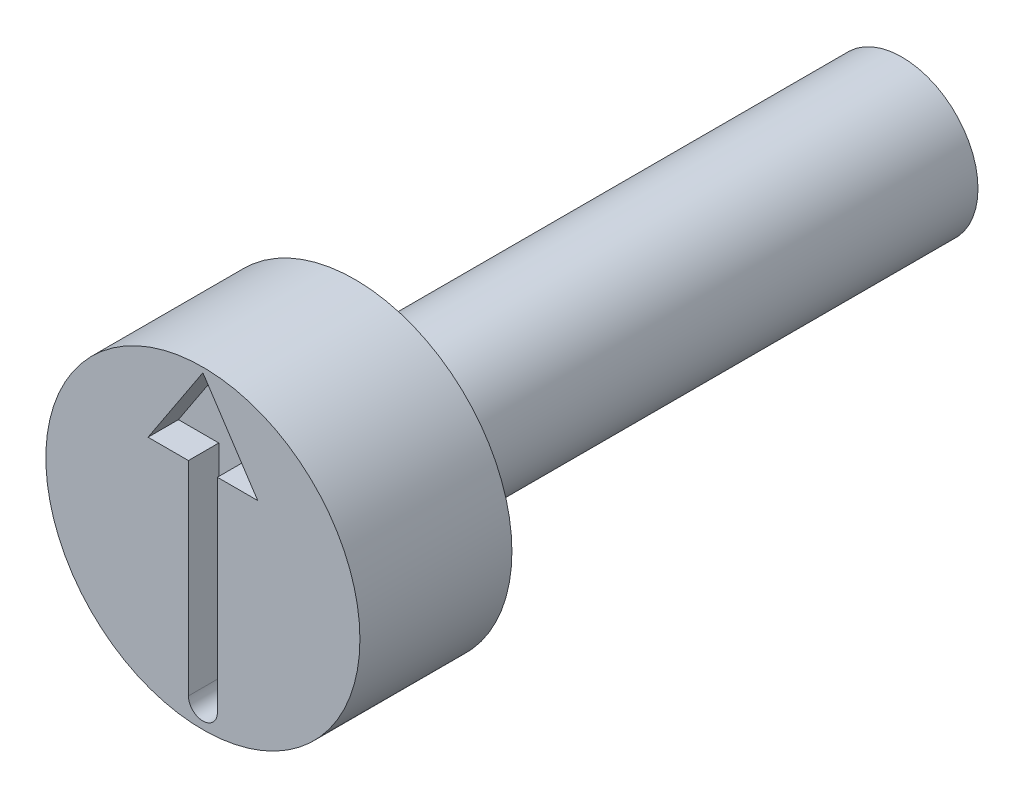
ISO-10303-21;
HEADER;
FILE_DESCRIPTION(('STEP AP214'),'2;1');
FILE_NAME('part.step','',(''),(''),'','','');
FILE_SCHEMA(('AUTOMOTIVE_DESIGN { 1 0 10303 214 1 1 1 1 }'));
ENDSEC;
DATA;
#1=APPLICATION_CONTEXT('core data for automotive mechanical design processes');
#2=APPLICATION_PROTOCOL_DEFINITION('international standard','automotive_design',2000,#1);
#3=PRODUCT_CONTEXT('',#1,'mechanical');
#4=PRODUCT('Part','Part','',(#3));
#5=PRODUCT_RELATED_PRODUCT_CATEGORY('part','',(#4));
#6=PRODUCT_DEFINITION_FORMATION('','',#4);
#7=PRODUCT_DEFINITION_CONTEXT('part definition',#1,'design');
#8=PRODUCT_DEFINITION('design','',#6,#7);
#9=PRODUCT_DEFINITION_SHAPE('','',#8);
#10=(LENGTH_UNIT() NAMED_UNIT(*) SI_UNIT(.MILLI.,.METRE.));
#11=(NAMED_UNIT(*) PLANE_ANGLE_UNIT() SI_UNIT($,.RADIAN.));
#12=(NAMED_UNIT(*) SI_UNIT($,.STERADIAN.) SOLID_ANGLE_UNIT());
#13=UNCERTAINTY_MEASURE_WITH_UNIT(LENGTH_MEASURE(1.E-05),#10,'distance_accuracy_value','');
#14=(GEOMETRIC_REPRESENTATION_CONTEXT(3) GLOBAL_UNCERTAINTY_ASSIGNED_CONTEXT((#13)) GLOBAL_UNIT_ASSIGNED_CONTEXT((#10,
#11,#12)) REPRESENTATION_CONTEXT('',''));
#15=CARTESIAN_POINT('',(0.,0.,0.));
#16=DIRECTION('',(0.,0.,1.));
#17=DIRECTION('',(1.,0.,0.));
#18=AXIS2_PLACEMENT_3D('',#15,#16,#17);
#19=CARTESIAN_POINT('',(0.,1.5,-3.));
#20=DIRECTION('',(0.,0.,1.));
#21=DIRECTION('',(1.,0.,0.));
#22=AXIS2_PLACEMENT_3D('',#19,#20,#21);
#23=PLANE('',#22);
#24=CARTESIAN_POINT('',(0.,0.,-3.));
#25=DIRECTION('',(0.,0.,1.));
#26=DIRECTION('',(1.,0.,0.));
#27=AXIS2_PLACEMENT_3D('',#24,#25,#26);
#28=CIRCLE('',#27,3.1);
#29=CARTESIAN_POINT('',(3.1,0.,-3.));
#30=VERTEX_POINT('',#29);
#31=EDGE_CURVE('E11',#30,#30,#28,.T.);
#32=ORIENTED_EDGE('',*,*,#31,.F.);
#33=EDGE_LOOP('',(#32));
#34=FACE_BOUND('',#33,.T.);
#35=CARTESIAN_POINT('',(0.,0.,-3.));
#36=DIRECTION('',(0.,0.,1.));
#37=DIRECTION('',(1.,0.,0.));
#38=AXIS2_PLACEMENT_3D('',#35,#36,#37);
#39=CIRCLE('',#38,1.5);
#40=CARTESIAN_POINT('',(1.5,0.,-3.));
#41=VERTEX_POINT('',#40);
#42=EDGE_CURVE('E144',#41,#41,#39,.T.);
#43=ORIENTED_EDGE('',*,*,#42,.T.);
#44=EDGE_LOOP('',(#43));
#45=FACE_BOUND('',#44,.T.);
#46=ADVANCED_FACE('F34',(#34,#45),#23,.F.);
#47=CARTESIAN_POINT('',(0.,0.,-0.403888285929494));
#48=DIRECTION('',(0.,0.,1.));
#49=DIRECTION('',(1.,0.,0.));
#50=AXIS2_PLACEMENT_3D('',#47,#48,#49);
#51=CYLINDRICAL_SURFACE('',#50,3.1);
#52=CARTESIAN_POINT('',(0.,0.,0.));
#53=DIRECTION('',(0.,0.,1.));
#54=DIRECTION('',(1.,0.,0.));
#55=AXIS2_PLACEMENT_3D('',#52,#53,#54);
#56=CIRCLE('',#55,3.1);
#57=CARTESIAN_POINT('',(3.1,0.,0.));
#58=VERTEX_POINT('',#57);
#59=EDGE_CURVE('E41',#58,#58,#56,.T.);
#60=ORIENTED_EDGE('',*,*,#59,.F.);
#61=EDGE_LOOP('',(#60));
#62=FACE_BOUND('',#61,.T.);
#63=ORIENTED_EDGE('',*,*,#31,.T.);
#64=EDGE_LOOP('',(#63));
#65=FACE_BOUND('',#64,.T.);
#66=ADVANCED_FACE('F161',(#62,#65),#51,.T.);
#67=CARTESIAN_POINT('',(0.,3.1,0.));
#68=DIRECTION('',(0.,0.,-1.));
#69=DIRECTION('',(-1.,0.,0.));
#70=AXIS2_PLACEMENT_3D('',#67,#68,#69);
#71=PLANE('',#70);
#72=DIRECTION('',(0.,1.,0.));
#73=VECTOR('',#72,1.);
#74=CARTESIAN_POINT('',(0.28570968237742,1.35952714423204,0.));
#75=LINE('',#74,#73);
#76=CARTESIAN_POINT('',(0.285709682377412,-2.66424275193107,0.));
#77=VERTEX_POINT('',#76);
#78=CARTESIAN_POINT('',(0.28570968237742,1.35952714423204,0.));
#79=VERTEX_POINT('',#78);
#80=EDGE_CURVE('E128',#77,#79,#75,.T.);
#81=ORIENTED_EDGE('',*,*,#80,.F.);
#82=CARTESIAN_POINT('',(2.4513673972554E-13,-2.66424275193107,0.));
#83=DIRECTION('',(0.,0.,1.));
#84=DIRECTION('',(1.,0.,0.));
#85=AXIS2_PLACEMENT_3D('',#82,#83,#84);
#86=CIRCLE('',#85,0.285709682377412);
#87=CARTESIAN_POINT('',(-0.285709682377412,-2.66424275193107,0.));
#88=VERTEX_POINT('',#87);
#89=EDGE_CURVE('E48',#88,#77,#86,.T.);
#90=ORIENTED_EDGE('',*,*,#89,.F.);
#91=DIRECTION('',(0.,-1.,0.));
#92=VECTOR('',#91,1.);
#93=CARTESIAN_POINT('',(-0.28570968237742,1.35952714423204,0.));
#94=LINE('',#93,#92);
#95=CARTESIAN_POINT('',(-0.28570968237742,1.35952714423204,0.));
#96=VERTEX_POINT('',#95);
#97=EDGE_CURVE('E140',#96,#88,#94,.T.);
#98=ORIENTED_EDGE('',*,*,#97,.F.);
#99=DIRECTION('',(1.,0.,0.));
#100=VECTOR('',#99,1.);
#101=CARTESIAN_POINT('',(-1.08287651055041,1.35952714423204,0.));
#102=LINE('',#101,#100);
#103=CARTESIAN_POINT('',(-1.08287651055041,1.35952714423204,0.));
#104=VERTEX_POINT('',#103);
#105=EDGE_CURVE('E138',#104,#96,#102,.T.);
#106=ORIENTED_EDGE('',*,*,#105,.F.);
#107=DIRECTION('',(-0.550159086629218,-0.835059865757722,0.));
#108=VECTOR('',#107,1.);
#109=CARTESIAN_POINT('',(0.,3.00317301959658,0.));
#110=LINE('',#109,#108);
#111=CARTESIAN_POINT('',(0.,3.00317301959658,0.));
#112=VERTEX_POINT('',#111);
#113=EDGE_CURVE('E102',#112,#104,#110,.T.);
#114=ORIENTED_EDGE('',*,*,#113,.F.);
#115=DIRECTION('',(-0.550159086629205,0.835059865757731,0.));
#116=VECTOR('',#115,1.);
#117=CARTESIAN_POINT('',(0.,3.00317301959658,0.));
#118=LINE('',#117,#116);
#119=CARTESIAN_POINT('',(1.08287651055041,1.35952714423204,0.));
#120=VERTEX_POINT('',#119);
#121=EDGE_CURVE('E134',#120,#112,#118,.T.);
#122=ORIENTED_EDGE('',*,*,#121,.F.);
#123=DIRECTION('',(1.,0.,0.));
#124=VECTOR('',#123,1.);
#125=CARTESIAN_POINT('',(1.08287651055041,1.35952714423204,0.));
#126=LINE('',#125,#124);
#127=EDGE_CURVE('E131',#79,#120,#126,.T.);
#128=ORIENTED_EDGE('',*,*,#127,.F.);
#129=EDGE_LOOP('',(#81,#90,#98,#106,#114,#122,#128));
#130=FACE_BOUND('',#129,.T.);
#131=ORIENTED_EDGE('',*,*,#59,.T.);
#132=EDGE_LOOP('',(#131));
#133=FACE_BOUND('',#132,.T.);
#134=ADVANCED_FACE('F159',(#130,#133),#71,.F.);
#135=CARTESIAN_POINT('',(0.,0.,-13.8));
#136=DIRECTION('',(0.,0.,1.));
#137=DIRECTION('',(1.,0.,0.));
#138=AXIS2_PLACEMENT_3D('',#135,#136,#137);
#139=PLANE('',#138);
#140=CARTESIAN_POINT('',(0.,0.,-13.8));
#141=DIRECTION('',(0.,0.,1.));
#142=DIRECTION('',(1.,0.,0.));
#143=AXIS2_PLACEMENT_3D('',#140,#141,#142);
#144=CIRCLE('',#143,1.5);
#145=CARTESIAN_POINT('',(1.5,0.,-13.8));
#146=VERTEX_POINT('',#145);
#147=EDGE_CURVE('E154',#146,#146,#144,.T.);
#148=ORIENTED_EDGE('',*,*,#147,.F.);
#149=EDGE_LOOP('',(#148));
#150=FACE_BOUND('',#149,.T.);
#151=ADVANCED_FACE('F174',(#150),#139,.F.);
#152=CARTESIAN_POINT('',(0.,0.,-0.403888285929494));
#153=DIRECTION('',(0.,0.,1.));
#154=DIRECTION('',(1.,0.,0.));
#155=AXIS2_PLACEMENT_3D('',#152,#153,#154);
#156=CYLINDRICAL_SURFACE('',#155,1.5);
#157=ORIENTED_EDGE('',*,*,#42,.F.);
#158=EDGE_LOOP('',(#157));
#159=FACE_BOUND('',#158,.T.);
#160=ORIENTED_EDGE('',*,*,#147,.T.);
#161=EDGE_LOOP('',(#160));
#162=FACE_BOUND('',#161,.T.);
#163=ADVANCED_FACE('F170',(#159,#162),#156,.T.);
#164=CARTESIAN_POINT('',(2.4513673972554E-13,-2.66424275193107,-0.6));
#165=DIRECTION('',(0.,0.,1.));
#166=DIRECTION('',(1.,0.,0.));
#167=AXIS2_PLACEMENT_3D('',#164,#165,#166);
#168=CYLINDRICAL_SURFACE('',#167,0.285709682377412);
#169=ORIENTED_EDGE('',*,*,#89,.T.);
#170=DIRECTION('',(0.,0.,1.));
#171=VECTOR('',#170,1.);
#172=CARTESIAN_POINT('',(0.285709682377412,-2.66424275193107,-0.6));
#173=LINE('',#172,#171);
#174=CARTESIAN_POINT('',(0.285709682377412,-2.66424275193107,-0.6));
#175=VERTEX_POINT('',#174);
#176=EDGE_CURVE('E81',#175,#77,#173,.T.);
#177=ORIENTED_EDGE('',*,*,#176,.F.);
#178=CARTESIAN_POINT('',(2.4513673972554E-13,-2.66424275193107,-0.6));
#179=DIRECTION('',(0.,0.,1.));
#180=DIRECTION('',(1.,0.,0.));
#181=AXIS2_PLACEMENT_3D('',#178,#179,#180);
#182=CIRCLE('',#181,0.285709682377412);
#183=CARTESIAN_POINT('',(-0.285709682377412,-2.66424275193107,-0.6));
#184=VERTEX_POINT('',#183);
#185=EDGE_CURVE('E142',#184,#175,#182,.T.);
#186=ORIENTED_EDGE('',*,*,#185,.F.);
#187=DIRECTION('',(0.,0.,1.));
#188=VECTOR('',#187,1.);
#189=CARTESIAN_POINT('',(-0.285709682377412,-2.66424275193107,-0.6));
#190=LINE('',#189,#188);
#191=EDGE_CURVE('E56',#184,#88,#190,.T.);
#192=ORIENTED_EDGE('',*,*,#191,.T.);
#193=EDGE_LOOP('',(#169,#177,#186,#192));
#194=FACE_BOUND('',#193,.T.);
#195=ADVANCED_FACE('F173',(#194),#168,.F.);
#196=CARTESIAN_POINT('',(-0.28570968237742,1.35952714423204,-0.6));
#197=DIRECTION('',(-1.,0.,0.));
#198=DIRECTION('',(0.,-1.,0.));
#199=AXIS2_PLACEMENT_3D('',#196,#197,#198);
#200=PLANE('',#199);
#201=ORIENTED_EDGE('',*,*,#97,.T.);
#202=ORIENTED_EDGE('',*,*,#191,.F.);
#203=DIRECTION('',(0.,-1.,0.));
#204=VECTOR('',#203,1.);
#205=CARTESIAN_POINT('',(-0.28570968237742,1.35952714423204,-0.6));
#206=LINE('',#205,#204);
#207=CARTESIAN_POINT('',(-0.28570968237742,1.35952714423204,-0.6));
#208=VERTEX_POINT('',#207);
#209=EDGE_CURVE('E114',#208,#184,#206,.T.);
#210=ORIENTED_EDGE('',*,*,#209,.F.);
#211=DIRECTION('',(0.,0.,1.));
#212=VECTOR('',#211,1.);
#213=CARTESIAN_POINT('',(-0.28570968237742,1.35952714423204,-0.6));
#214=LINE('',#213,#212);
#215=EDGE_CURVE('E106',#208,#96,#214,.T.);
#216=ORIENTED_EDGE('',*,*,#215,.T.);
#217=EDGE_LOOP('',(#201,#202,#210,#216));
#218=FACE_BOUND('',#217,.T.);
#219=ADVANCED_FACE('F188',(#218),#200,.F.);
#220=CARTESIAN_POINT('',(-1.08287651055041,1.35952714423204,-0.6));
#221=DIRECTION('',(0.,-1.,0.));
#222=DIRECTION('',(0.,0.,-1.));
#223=AXIS2_PLACEMENT_3D('',#220,#221,#222);
#224=PLANE('',#223);
#225=ORIENTED_EDGE('',*,*,#105,.T.);
#226=ORIENTED_EDGE('',*,*,#215,.F.);
#227=DIRECTION('',(1.,0.,0.));
#228=VECTOR('',#227,1.);
#229=CARTESIAN_POINT('',(-1.08287651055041,1.35952714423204,-0.6));
#230=LINE('',#229,#228);
#231=CARTESIAN_POINT('',(-1.08287651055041,1.35952714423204,-0.6));
#232=VERTEX_POINT('',#231);
#233=EDGE_CURVE('E110',#232,#208,#230,.T.);
#234=ORIENTED_EDGE('',*,*,#233,.F.);
#235=DIRECTION('',(0.,0.,1.));
#236=VECTOR('',#235,1.);
#237=CARTESIAN_POINT('',(-1.08287651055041,1.35952714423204,-0.6));
#238=LINE('',#237,#236);
#239=EDGE_CURVE('E95',#232,#104,#238,.T.);
#240=ORIENTED_EDGE('',*,*,#239,.T.);
#241=EDGE_LOOP('',(#225,#226,#234,#240));
#242=FACE_BOUND('',#241,.T.);
#243=ADVANCED_FACE('F111',(#242),#224,.F.);
#244=CARTESIAN_POINT('',(0.,3.00317301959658,-0.6));
#245=DIRECTION('',(-0.835059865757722,0.550159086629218,0.));
#246=DIRECTION('',(-0.550159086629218,-0.835059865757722,0.));
#247=AXIS2_PLACEMENT_3D('',#244,#245,#246);
#248=PLANE('',#247);
#249=ORIENTED_EDGE('',*,*,#113,.T.);
#250=ORIENTED_EDGE('',*,*,#239,.F.);
#251=DIRECTION('',(-0.550159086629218,-0.835059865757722,0.));
#252=VECTOR('',#251,1.);
#253=CARTESIAN_POINT('',(0.,3.00317301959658,-0.6));
#254=LINE('',#253,#252);
#255=CARTESIAN_POINT('',(0.,3.00317301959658,-0.6));
#256=VERTEX_POINT('',#255);
#257=EDGE_CURVE('E99',#256,#232,#254,.T.);
#258=ORIENTED_EDGE('',*,*,#257,.F.);
#259=DIRECTION('',(0.,0.,1.));
#260=VECTOR('',#259,1.);
#261=CARTESIAN_POINT('',(0.,3.00317301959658,-0.6));
#262=LINE('',#261,#260);
#263=EDGE_CURVE('E107',#256,#112,#262,.T.);
#264=ORIENTED_EDGE('',*,*,#263,.T.);
#265=EDGE_LOOP('',(#249,#250,#258,#264));
#266=FACE_BOUND('',#265,.T.);
#267=ADVANCED_FACE('F97',(#266),#248,.F.);
#268=CARTESIAN_POINT('',(0.,3.00317301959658,-0.6));
#269=DIRECTION('',(0.835059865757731,0.550159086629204,0.));
#270=DIRECTION('',(-0.550159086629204,0.835059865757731,0.));
#271=AXIS2_PLACEMENT_3D('',#268,#269,#270);
#272=PLANE('',#271);
#273=ORIENTED_EDGE('',*,*,#121,.T.);
#274=ORIENTED_EDGE('',*,*,#263,.F.);
#275=DIRECTION('',(-0.550159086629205,0.835059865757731,0.));
#276=VECTOR('',#275,1.);
#277=CARTESIAN_POINT('',(0.,3.00317301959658,-0.6));
#278=LINE('',#277,#276);
#279=CARTESIAN_POINT('',(1.08287651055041,1.35952714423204,-0.6));
#280=VERTEX_POINT('',#279);
#281=EDGE_CURVE('E120',#280,#256,#278,.T.);
#282=ORIENTED_EDGE('',*,*,#281,.F.);
#283=DIRECTION('',(0.,0.,1.));
#284=VECTOR('',#283,1.);
#285=CARTESIAN_POINT('',(1.08287651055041,1.35952714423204,-0.6));
#286=LINE('',#285,#284);
#287=EDGE_CURVE('E147',#280,#120,#286,.T.);
#288=ORIENTED_EDGE('',*,*,#287,.T.);
#289=EDGE_LOOP('',(#273,#274,#282,#288));
#290=FACE_BOUND('',#289,.T.);
#291=ADVANCED_FACE('F196',(#290),#272,.F.);
#292=CARTESIAN_POINT('',(1.08287651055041,1.35952714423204,-0.6));
#293=DIRECTION('',(0.,-1.,0.));
#294=DIRECTION('',(0.,0.,-1.));
#295=AXIS2_PLACEMENT_3D('',#292,#293,#294);
#296=PLANE('',#295);
#297=ORIENTED_EDGE('',*,*,#127,.T.);
#298=ORIENTED_EDGE('',*,*,#287,.F.);
#299=DIRECTION('',(1.,0.,0.));
#300=VECTOR('',#299,1.);
#301=CARTESIAN_POINT('',(1.08287651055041,1.35952714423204,-0.6));
#302=LINE('',#301,#300);
#303=CARTESIAN_POINT('',(0.28570968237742,1.35952714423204,-0.6));
#304=VERTEX_POINT('',#303);
#305=EDGE_CURVE('E122',#304,#280,#302,.T.);
#306=ORIENTED_EDGE('',*,*,#305,.F.);
#307=DIRECTION('',(0.,0.,1.));
#308=VECTOR('',#307,1.);
#309=CARTESIAN_POINT('',(0.28570968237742,1.35952714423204,-0.6));
#310=LINE('',#309,#308);
#311=EDGE_CURVE('E149',#304,#79,#310,.T.);
#312=ORIENTED_EDGE('',*,*,#311,.T.);
#313=EDGE_LOOP('',(#297,#298,#306,#312));
#314=FACE_BOUND('',#313,.T.);
#315=ADVANCED_FACE('F192',(#314),#296,.F.);
#316=CARTESIAN_POINT('',(0.28570968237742,1.35952714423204,-0.6));
#317=DIRECTION('',(1.,0.,0.));
#318=DIRECTION('',(0.,1.,0.));
#319=AXIS2_PLACEMENT_3D('',#316,#317,#318);
#320=PLANE('',#319);
#321=ORIENTED_EDGE('',*,*,#80,.T.);
#322=ORIENTED_EDGE('',*,*,#311,.F.);
#323=DIRECTION('',(0.,1.,0.));
#324=VECTOR('',#323,1.);
#325=CARTESIAN_POINT('',(0.28570968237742,1.35952714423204,-0.6));
#326=LINE('',#325,#324);
#327=EDGE_CURVE('E290',#175,#304,#326,.T.);
#328=ORIENTED_EDGE('',*,*,#327,.F.);
#329=ORIENTED_EDGE('',*,*,#176,.T.);
#330=EDGE_LOOP('',(#321,#322,#328,#329));
#331=FACE_BOUND('',#330,.T.);
#332=ADVANCED_FACE('F189',(#331),#320,.F.);
#333=CARTESIAN_POINT('',(2.4513673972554E-13,-2.66424275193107,-0.6));
#334=DIRECTION('',(0.,0.,1.));
#335=DIRECTION('',(1.,0.,0.));
#336=AXIS2_PLACEMENT_3D('',#333,#334,#335);
#337=PLANE('',#336);
#338=ORIENTED_EDGE('',*,*,#185,.T.);
#339=ORIENTED_EDGE('',*,*,#327,.T.);
#340=ORIENTED_EDGE('',*,*,#305,.T.);
#341=ORIENTED_EDGE('',*,*,#281,.T.);
#342=ORIENTED_EDGE('',*,*,#257,.T.);
#343=ORIENTED_EDGE('',*,*,#233,.T.);
#344=ORIENTED_EDGE('',*,*,#209,.T.);
#345=EDGE_LOOP('',(#338,#339,#340,#341,#342,#343,#344));
#346=FACE_BOUND('',#345,.T.);
#347=ADVANCED_FACE('F117',(#346),#337,.T.);
#348=CLOSED_SHELL('',(#46,#66,#134,#151,#163,#195,#219,#243,#267,#291,#315,#332,#347));
#349=MANIFOLD_SOLID_BREP('B2',#348);
#350=ADVANCED_BREP_SHAPE_REPRESENTATION('',(#18,#349),#14);
#351=SHAPE_DEFINITION_REPRESENTATION(#9,#350);
ENDSEC;
END-ISO-10303-21;
